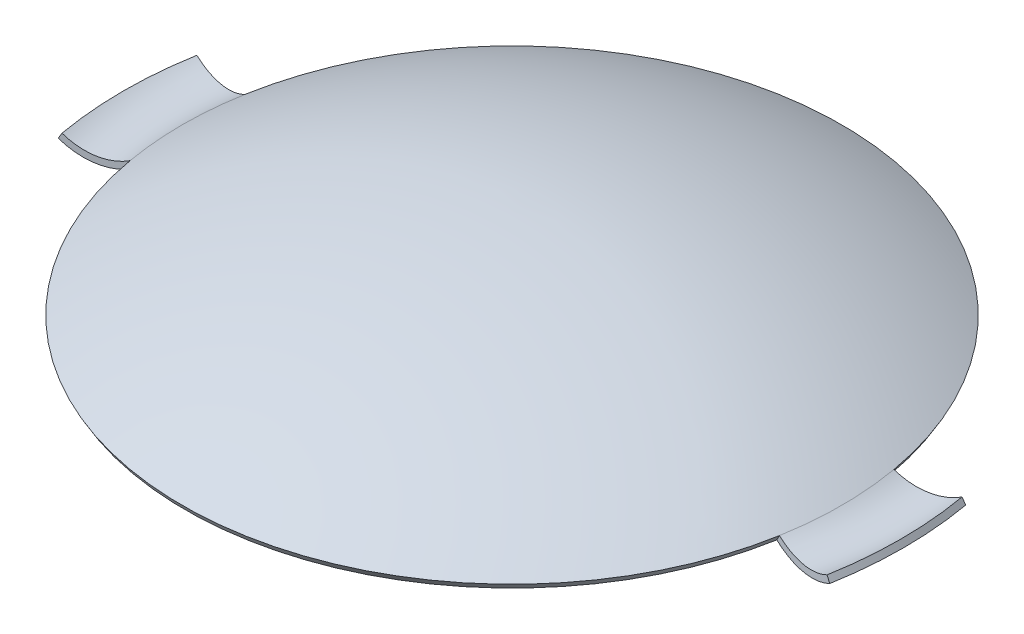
ISO-10303-21;
HEADER;
FILE_DESCRIPTION(('STEP AP214'),'2;1');
FILE_NAME('part.step','',(''),(''),'','','');
FILE_SCHEMA(('AUTOMOTIVE_DESIGN { 1 0 10303 214 1 1 1 1 }'));
ENDSEC;
DATA;
#1=APPLICATION_CONTEXT('core data for automotive mechanical design processes');
#2=APPLICATION_PROTOCOL_DEFINITION('international standard','automotive_design',2000,#1);
#3=PRODUCT_CONTEXT('',#1,'mechanical');
#4=PRODUCT('Part','Part','',(#3));
#5=PRODUCT_RELATED_PRODUCT_CATEGORY('part','',(#4));
#6=PRODUCT_DEFINITION_FORMATION('','',#4);
#7=PRODUCT_DEFINITION_CONTEXT('part definition',#1,'design');
#8=PRODUCT_DEFINITION('design','',#6,#7);
#9=PRODUCT_DEFINITION_SHAPE('','',#8);
#10=(LENGTH_UNIT() NAMED_UNIT(*) SI_UNIT(.MILLI.,.METRE.));
#11=(NAMED_UNIT(*) PLANE_ANGLE_UNIT() SI_UNIT($,.RADIAN.));
#12=(NAMED_UNIT(*) SI_UNIT($,.STERADIAN.) SOLID_ANGLE_UNIT());
#13=UNCERTAINTY_MEASURE_WITH_UNIT(LENGTH_MEASURE(1.E-05),#10,'distance_accuracy_value','');
#14=(GEOMETRIC_REPRESENTATION_CONTEXT(3) GLOBAL_UNCERTAINTY_ASSIGNED_CONTEXT((#13)) GLOBAL_UNIT_ASSIGNED_CONTEXT((#10,
#11,#12)) REPRESENTATION_CONTEXT('',''));
#15=CARTESIAN_POINT('',(0.,0.,0.));
#16=DIRECTION('',(0.,0.,1.));
#17=DIRECTION('',(1.,0.,0.));
#18=AXIS2_PLACEMENT_3D('',#15,#16,#17);
#19=CARTESIAN_POINT('',(0.,-25.0628684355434,0.));
#20=DIRECTION('',(0.,1.,0.));
#21=DIRECTION('',(-1.,0.,0.));
#22=AXIS2_PLACEMENT_3D('',#19,#20,#21);
#23=CONICAL_SURFACE('',#22,101.,0.523598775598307);
#24=CARTESIAN_POINT('',(0.,-26.7949192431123,0.));
#25=DIRECTION('',(0.,1.,0.));
#26=DIRECTION('',(-1.,0.,0.));
#27=AXIS2_PLACEMENT_3D('',#24,#25,#26);
#28=CIRCLE('',#27,100.);
#29=CARTESIAN_POINT('',(-98.4807753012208,-26.7949192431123,17.3648177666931));
#30=VERTEX_POINT('',#29);
#31=CARTESIAN_POINT('',(98.4807753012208,-26.7949192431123,17.3648177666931));
#32=VERTEX_POINT('',#31);
#33=EDGE_CURVE('E134',#30,#32,#28,.T.);
#34=ORIENTED_EDGE('',*,*,#33,.T.);
#35=DIRECTION('',(0.492403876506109,0.866025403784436,0.0868240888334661));
#36=VECTOR('',#35,1.);
#37=CARTESIAN_POINT('',(99.465583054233,-25.0628684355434,17.53846594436));
#38=LINE('',#37,#36);
#39=CARTESIAN_POINT('',(99.465583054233,-25.0628684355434,17.53846594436));
#40=VERTEX_POINT('',#39);
#41=EDGE_CURVE('E175',#32,#40,#38,.T.);
#42=ORIENTED_EDGE('',*,*,#41,.T.);
#43=CARTESIAN_POINT('',(0.,-25.0628684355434,0.));
#44=DIRECTION('',(0.,1.,0.));
#45=DIRECTION('',(-1.,0.,0.));
#46=AXIS2_PLACEMENT_3D('',#43,#44,#45);
#47=CIRCLE('',#46,101.);
#48=CARTESIAN_POINT('',(-99.465583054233,-25.0628684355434,17.53846594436));
#49=VERTEX_POINT('',#48);
#50=EDGE_CURVE('E11',#49,#40,#47,.T.);
#51=ORIENTED_EDGE('',*,*,#50,.F.);
#52=DIRECTION('',(-0.492403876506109,0.866025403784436,0.0868240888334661));
#53=VECTOR('',#52,1.);
#54=CARTESIAN_POINT('',(-99.465583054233,-25.0628684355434,17.53846594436));
#55=LINE('',#54,#53);
#56=EDGE_CURVE('E150',#30,#49,#55,.T.);
#57=ORIENTED_EDGE('',*,*,#56,.F.);
#58=EDGE_LOOP('',(#34,#42,#51,#57));
#59=FACE_BOUND('',#58,.T.);
#60=ADVANCED_FACE('F37',(#59),#23,.T.);
#61=DIRECTION('',(0.492403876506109,0.866025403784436,-0.0868240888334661));
#62=VECTOR('',#61,1.);
#63=CARTESIAN_POINT('',(99.465583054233,-25.0628684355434,-17.53846594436));
#64=LINE('',#63,#62);
#65=CARTESIAN_POINT('',(98.4807753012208,-26.7949192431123,-17.3648177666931));
#66=VERTEX_POINT('',#65);
#67=CARTESIAN_POINT('',(99.465583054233,-25.0628684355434,-17.53846594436));
#68=VERTEX_POINT('',#67);
#69=EDGE_CURVE('E106',#66,#68,#64,.T.);
#70=ORIENTED_EDGE('',*,*,#69,.F.);
#71=CARTESIAN_POINT('',(-98.4807753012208,-26.7949192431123,-17.3648177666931));
#72=VERTEX_POINT('',#71);
#73=EDGE_CURVE('E128',#66,#72,#28,.T.);
#74=ORIENTED_EDGE('',*,*,#73,.T.);
#75=DIRECTION('',(-0.492403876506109,0.866025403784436,-0.0868240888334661));
#76=VECTOR('',#75,1.);
#77=CARTESIAN_POINT('',(-99.465583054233,-25.0628684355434,-17.53846594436));
#78=LINE('',#77,#76);
#79=CARTESIAN_POINT('',(-99.465583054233,-25.0628684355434,-17.53846594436));
#80=VERTEX_POINT('',#79);
#81=EDGE_CURVE('E162',#72,#80,#78,.T.);
#82=ORIENTED_EDGE('',*,*,#81,.T.);
#83=EDGE_CURVE('E45',#68,#80,#47,.T.);
#84=ORIENTED_EDGE('',*,*,#83,.F.);
#85=EDGE_LOOP('',(#70,#74,#82,#84));
#86=FACE_BOUND('',#85,.T.);
#87=ADVANCED_FACE('F127',(#86),#23,.T.);
#88=CARTESIAN_POINT('',(0.,-200.,0.));
#89=DIRECTION('',(0.,1.,0.));
#90=DIRECTION('',(-1.,0.,0.));
#91=AXIS2_PLACEMENT_3D('',#88,#89,#90);
#92=SPHERICAL_SURFACE('',#91,200.);
#93=ORIENTED_EDGE('',*,*,#33,.F.);
#94=CARTESIAN_POINT('',(0.,-26.7949192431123,0.));
#95=DIRECTION('',(0.,-1.,0.));
#96=DIRECTION('',(1.,0.,0.));
#97=AXIS2_PLACEMENT_3D('',#94,#95,#96);
#98=CIRCLE('',#97,100.);
#99=EDGE_CURVE('E132',#30,#72,#98,.T.);
#100=ORIENTED_EDGE('',*,*,#99,.T.);
#101=ORIENTED_EDGE('',*,*,#73,.F.);
#102=CARTESIAN_POINT('',(0.,-26.7949192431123,0.));
#103=DIRECTION('',(0.,1.,0.));
#104=DIRECTION('',(-1.,0.,0.));
#105=AXIS2_PLACEMENT_3D('',#102,#103,#104);
#106=CIRCLE('',#105,100.);
#107=EDGE_CURVE('E115',#32,#66,#106,.T.);
#108=ORIENTED_EDGE('',*,*,#107,.F.);
#109=EDGE_LOOP('',(#93,#100,#101,#108));
#110=FACE_BOUND('',#109,.T.);
#111=ADVANCED_FACE('F39',(#110),#92,.F.);
#112=CARTESIAN_POINT('',(0.,-200.,0.));
#113=DIRECTION('',(0.,1.,0.));
#114=DIRECTION('',(-1.,0.,0.));
#115=AXIS2_PLACEMENT_3D('',#112,#113,#114);
#116=SPHERICAL_SURFACE('',#115,202.);
#117=ORIENTED_EDGE('',*,*,#50,.T.);
#118=CARTESIAN_POINT('',(0.,-25.0628684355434,0.));
#119=DIRECTION('',(0.,1.,0.));
#120=DIRECTION('',(-1.,0.,0.));
#121=AXIS2_PLACEMENT_3D('',#118,#119,#120);
#122=CIRCLE('',#121,101.);
#123=EDGE_CURVE('E123',#40,#68,#122,.T.);
#124=ORIENTED_EDGE('',*,*,#123,.T.);
#125=ORIENTED_EDGE('',*,*,#83,.T.);
#126=CARTESIAN_POINT('',(0.,-25.0628684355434,0.));
#127=DIRECTION('',(0.,-1.,0.));
#128=DIRECTION('',(1.,0.,0.));
#129=AXIS2_PLACEMENT_3D('',#126,#127,#128);
#130=CIRCLE('',#129,101.);
#131=EDGE_CURVE('E140',#49,#80,#130,.T.);
#132=ORIENTED_EDGE('',*,*,#131,.F.);
#133=EDGE_LOOP('',(#117,#124,#125,#132));
#134=FACE_BOUND('',#133,.T.);
#135=ADVANCED_FACE('F189',(#134),#116,.T.);
#136=CARTESIAN_POINT('',(0.,-9.47441116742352,0.));
#137=DIRECTION('',(0.,-1.,0.));
#138=DIRECTION('',(1.,0.,0.));
#139=AXIS2_PLACEMENT_3D('',#136,#137,#138);
#140=TOROIDAL_SURFACE('',#139,110.,20.);
#141=CARTESIAN_POINT('',(0.,-26.7949192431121,0.));
#142=DIRECTION('',(0.,-1.,0.));
#143=DIRECTION('',(1.,0.,0.));
#144=AXIS2_PLACEMENT_3D('',#141,#142,#143);
#145=CIRCLE('',#144,120.);
#146=CARTESIAN_POINT('',(-118.176930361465,-26.7949192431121,20.8377813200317));
#147=VERTEX_POINT('',#146);
#148=CARTESIAN_POINT('',(-118.176930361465,-26.7949192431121,-20.8377813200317));
#149=VERTEX_POINT('',#148);
#150=EDGE_CURVE('E135',#147,#149,#145,.T.);
#151=ORIENTED_EDGE('',*,*,#150,.T.);
#152=CARTESIAN_POINT('',(-108.328852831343,-9.47441116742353,-19.1012995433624));
#153=DIRECTION('',(-0.173648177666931,0.,0.984807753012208));
#154=DIRECTION('',(-0.984807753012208,0.,-0.173648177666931));
#155=AXIS2_PLACEMENT_3D('',#152,#153,#154);
#156=CIRCLE('',#155,20.);
#157=EDGE_CURVE('E164',#149,#72,#156,.T.);
#158=ORIENTED_EDGE('',*,*,#157,.T.);
#159=ORIENTED_EDGE('',*,*,#99,.F.);
#160=CARTESIAN_POINT('',(-108.328852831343,-9.47441116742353,19.1012995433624));
#161=DIRECTION('',(0.173648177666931,0.,0.984807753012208));
#162=DIRECTION('',(-0.984807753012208,0.,0.173648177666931));
#163=AXIS2_PLACEMENT_3D('',#160,#161,#162);
#164=CIRCLE('',#163,20.);
#165=EDGE_CURVE('E153',#147,#30,#164,.T.);
#166=ORIENTED_EDGE('',*,*,#165,.F.);
#167=EDGE_LOOP('',(#151,#158,#159,#166));
#168=FACE_BOUND('',#167,.T.);
#169=ADVANCED_FACE('F205',(#168),#140,.T.);
#170=CARTESIAN_POINT('',(0.,-25.0628684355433,0.));
#171=DIRECTION('',(0.,-1.,0.));
#172=DIRECTION('',(1.,0.,0.));
#173=AXIS2_PLACEMENT_3D('',#170,#171,#172);
#174=CONICAL_SURFACE('',#173,119.,0.523598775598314);
#175=CARTESIAN_POINT('',(0.,-25.0628684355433,0.));
#176=DIRECTION('',(0.,-1.,0.));
#177=DIRECTION('',(1.,0.,0.));
#178=AXIS2_PLACEMENT_3D('',#175,#176,#177);
#179=CIRCLE('',#178,119.);
#180=CARTESIAN_POINT('',(-117.192122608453,-25.0628684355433,20.6641331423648));
#181=VERTEX_POINT('',#180);
#182=CARTESIAN_POINT('',(-117.192122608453,-25.0628684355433,-20.6641331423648));
#183=VERTEX_POINT('',#182);
#184=EDGE_CURVE('E136',#181,#183,#179,.T.);
#185=ORIENTED_EDGE('',*,*,#184,.T.);
#186=DIRECTION('',(-0.492403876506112,-0.866025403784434,-0.0868240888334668));
#187=VECTOR('',#186,1.);
#188=CARTESIAN_POINT('',(-117.192122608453,-25.0628684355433,-20.6641331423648));
#189=LINE('',#188,#187);
#190=EDGE_CURVE('E156',#183,#149,#189,.T.);
#191=ORIENTED_EDGE('',*,*,#190,.T.);
#192=ORIENTED_EDGE('',*,*,#150,.F.);
#193=DIRECTION('',(-0.492403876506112,-0.866025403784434,0.0868240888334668));
#194=VECTOR('',#193,1.);
#195=CARTESIAN_POINT('',(-117.192122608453,-25.0628684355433,20.6641331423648));
#196=LINE('',#195,#194);
#197=EDGE_CURVE('E144',#181,#147,#196,.T.);
#198=ORIENTED_EDGE('',*,*,#197,.F.);
#199=EDGE_LOOP('',(#185,#191,#192,#198));
#200=FACE_BOUND('',#199,.T.);
#201=ADVANCED_FACE('F199',(#200),#174,.T.);
#202=CARTESIAN_POINT('',(0.,-9.47441116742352,0.));
#203=DIRECTION('',(0.,-1.,0.));
#204=DIRECTION('',(1.,0.,0.));
#205=AXIS2_PLACEMENT_3D('',#202,#203,#204);
#206=TOROIDAL_SURFACE('',#205,110.,18.);
#207=ORIENTED_EDGE('',*,*,#131,.T.);
#208=CARTESIAN_POINT('',(-108.328852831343,-9.47441116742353,-19.1012995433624));
#209=DIRECTION('',(0.173648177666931,0.,-0.984807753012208));
#210=DIRECTION('',(-0.984807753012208,0.,-0.173648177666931));
#211=AXIS2_PLACEMENT_3D('',#208,#209,#210);
#212=CIRCLE('',#211,18.);
#213=EDGE_CURVE('E159',#80,#183,#212,.T.);
#214=ORIENTED_EDGE('',*,*,#213,.T.);
#215=ORIENTED_EDGE('',*,*,#184,.F.);
#216=CARTESIAN_POINT('',(-108.328852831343,-9.47441116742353,19.1012995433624));
#217=DIRECTION('',(-0.173648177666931,0.,-0.984807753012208));
#218=DIRECTION('',(-0.984807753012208,0.,0.173648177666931));
#219=AXIS2_PLACEMENT_3D('',#216,#217,#218);
#220=CIRCLE('',#219,18.);
#221=EDGE_CURVE('E147',#49,#181,#220,.T.);
#222=ORIENTED_EDGE('',*,*,#221,.F.);
#223=EDGE_LOOP('',(#207,#214,#215,#222));
#224=FACE_BOUND('',#223,.T.);
#225=ADVANCED_FACE('F193',(#224),#206,.F.);
#226=CARTESIAN_POINT('',(-108.328852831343,-9.47441116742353,19.1012995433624));
#227=DIRECTION('',(-0.173648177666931,0.,-0.984807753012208));
#228=DIRECTION('',(-0.984807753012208,0.,0.173648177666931));
#229=AXIS2_PLACEMENT_3D('',#226,#227,#228);
#230=PLANE('',#229);
#231=ORIENTED_EDGE('',*,*,#165,.T.);
#232=ORIENTED_EDGE('',*,*,#56,.T.);
#233=ORIENTED_EDGE('',*,*,#221,.T.);
#234=ORIENTED_EDGE('',*,*,#197,.T.);
#235=EDGE_LOOP('',(#231,#232,#233,#234));
#236=FACE_BOUND('',#235,.T.);
#237=ADVANCED_FACE('F202',(#236),#230,.F.);
#238=CARTESIAN_POINT('',(-108.328852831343,-9.47441116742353,-19.1012995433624));
#239=DIRECTION('',(0.173648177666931,0.,-0.984807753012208));
#240=DIRECTION('',(-0.984807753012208,0.,-0.173648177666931));
#241=AXIS2_PLACEMENT_3D('',#238,#239,#240);
#242=PLANE('',#241);
#243=ORIENTED_EDGE('',*,*,#157,.F.);
#244=ORIENTED_EDGE('',*,*,#190,.F.);
#245=ORIENTED_EDGE('',*,*,#213,.F.);
#246=ORIENTED_EDGE('',*,*,#81,.F.);
#247=EDGE_LOOP('',(#243,#244,#245,#246));
#248=FACE_BOUND('',#247,.T.);
#249=ADVANCED_FACE('F197',(#248),#242,.T.);
#250=CARTESIAN_POINT('',(0.,-9.47441116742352,0.));
#251=DIRECTION('',(0.,-1.,0.));
#252=DIRECTION('',(-1.,0.,0.));
#253=AXIS2_PLACEMENT_3D('',#250,#251,#252);
#254=TOROIDAL_SURFACE('',#253,110.,20.);
#255=CARTESIAN_POINT('',(0.,-26.7949192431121,0.));
#256=DIRECTION('',(0.,1.,0.));
#257=DIRECTION('',(-1.,0.,0.));
#258=AXIS2_PLACEMENT_3D('',#255,#256,#257);
#259=CIRCLE('',#258,120.);
#260=CARTESIAN_POINT('',(118.176930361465,-26.7949192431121,20.8377813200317));
#261=VERTEX_POINT('',#260);
#262=CARTESIAN_POINT('',(118.176930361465,-26.7949192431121,-20.8377813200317));
#263=VERTEX_POINT('',#262);
#264=EDGE_CURVE('E167',#261,#263,#259,.T.);
#265=ORIENTED_EDGE('',*,*,#264,.F.);
#266=CARTESIAN_POINT('',(108.328852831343,-9.47441116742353,19.1012995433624));
#267=DIRECTION('',(0.173648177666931,0.,-0.984807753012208));
#268=DIRECTION('',(0.984807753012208,0.,0.173648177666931));
#269=AXIS2_PLACEMENT_3D('',#266,#267,#268);
#270=CIRCLE('',#269,20.);
#271=EDGE_CURVE('E118',#261,#32,#270,.T.);
#272=ORIENTED_EDGE('',*,*,#271,.T.);
#273=ORIENTED_EDGE('',*,*,#107,.T.);
#274=CARTESIAN_POINT('',(108.328852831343,-9.47441116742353,-19.1012995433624));
#275=DIRECTION('',(-0.173648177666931,0.,-0.984807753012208));
#276=DIRECTION('',(0.984807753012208,0.,-0.173648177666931));
#277=AXIS2_PLACEMENT_3D('',#274,#275,#276);
#278=CIRCLE('',#277,20.);
#279=EDGE_CURVE('E102',#263,#66,#278,.T.);
#280=ORIENTED_EDGE('',*,*,#279,.F.);
#281=EDGE_LOOP('',(#265,#272,#273,#280));
#282=FACE_BOUND('',#281,.T.);
#283=ADVANCED_FACE('F116',(#282),#254,.T.);
#284=CARTESIAN_POINT('',(0.,-25.0628684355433,0.));
#285=DIRECTION('',(0.,-1.,0.));
#286=DIRECTION('',(-1.,0.,0.));
#287=AXIS2_PLACEMENT_3D('',#284,#285,#286);
#288=CONICAL_SURFACE('',#287,119.,0.523598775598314);
#289=CARTESIAN_POINT('',(0.,-25.0628684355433,0.));
#290=DIRECTION('',(0.,1.,0.));
#291=DIRECTION('',(-1.,0.,0.));
#292=AXIS2_PLACEMENT_3D('',#289,#290,#291);
#293=CIRCLE('',#292,119.);
#294=CARTESIAN_POINT('',(117.192122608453,-25.0628684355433,20.6641331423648));
#295=VERTEX_POINT('',#294);
#296=CARTESIAN_POINT('',(117.192122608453,-25.0628684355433,-20.6641331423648));
#297=VERTEX_POINT('',#296);
#298=EDGE_CURVE('E169',#295,#297,#293,.T.);
#299=ORIENTED_EDGE('',*,*,#298,.F.);
#300=DIRECTION('',(0.492403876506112,-0.866025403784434,0.0868240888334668));
#301=VECTOR('',#300,1.);
#302=CARTESIAN_POINT('',(117.192122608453,-25.0628684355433,20.6641331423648));
#303=LINE('',#302,#301);
#304=EDGE_CURVE('E124',#295,#261,#303,.T.);
#305=ORIENTED_EDGE('',*,*,#304,.T.);
#306=ORIENTED_EDGE('',*,*,#264,.T.);
#307=DIRECTION('',(0.492403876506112,-0.866025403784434,-0.0868240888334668));
#308=VECTOR('',#307,1.);
#309=CARTESIAN_POINT('',(117.192122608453,-25.0628684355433,-20.6641331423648));
#310=LINE('',#309,#308);
#311=EDGE_CURVE('E108',#297,#263,#310,.T.);
#312=ORIENTED_EDGE('',*,*,#311,.F.);
#313=EDGE_LOOP('',(#299,#305,#306,#312));
#314=FACE_BOUND('',#313,.T.);
#315=ADVANCED_FACE('F182',(#314),#288,.T.);
#316=CARTESIAN_POINT('',(0.,-9.47441116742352,0.));
#317=DIRECTION('',(0.,-1.,0.));
#318=DIRECTION('',(-1.,0.,0.));
#319=AXIS2_PLACEMENT_3D('',#316,#317,#318);
#320=TOROIDAL_SURFACE('',#319,110.,18.);
#321=ORIENTED_EDGE('',*,*,#123,.F.);
#322=CARTESIAN_POINT('',(108.328852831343,-9.47441116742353,19.1012995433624));
#323=DIRECTION('',(-0.173648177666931,0.,0.984807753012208));
#324=DIRECTION('',(0.984807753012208,0.,0.173648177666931));
#325=AXIS2_PLACEMENT_3D('',#322,#323,#324);
#326=CIRCLE('',#325,18.);
#327=EDGE_CURVE('E173',#40,#295,#326,.T.);
#328=ORIENTED_EDGE('',*,*,#327,.T.);
#329=ORIENTED_EDGE('',*,*,#298,.T.);
#330=CARTESIAN_POINT('',(108.328852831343,-9.47441116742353,-19.1012995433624));
#331=DIRECTION('',(0.173648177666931,0.,0.984807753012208));
#332=DIRECTION('',(0.984807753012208,0.,-0.173648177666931));
#333=AXIS2_PLACEMENT_3D('',#330,#331,#332);
#334=CIRCLE('',#333,18.);
#335=EDGE_CURVE('E52',#68,#297,#334,.T.);
#336=ORIENTED_EDGE('',*,*,#335,.F.);
#337=EDGE_LOOP('',(#321,#328,#329,#336));
#338=FACE_BOUND('',#337,.T.);
#339=ADVANCED_FACE('F183',(#338),#320,.F.);
#340=CARTESIAN_POINT('',(108.328852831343,-9.47441116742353,19.1012995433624));
#341=DIRECTION('',(0.173648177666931,0.,-0.984807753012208));
#342=DIRECTION('',(0.984807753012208,0.,0.173648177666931));
#343=AXIS2_PLACEMENT_3D('',#340,#341,#342);
#344=PLANE('',#343);
#345=ORIENTED_EDGE('',*,*,#271,.F.);
#346=ORIENTED_EDGE('',*,*,#304,.F.);
#347=ORIENTED_EDGE('',*,*,#327,.F.);
#348=ORIENTED_EDGE('',*,*,#41,.F.);
#349=EDGE_LOOP('',(#345,#346,#347,#348));
#350=FACE_BOUND('',#349,.T.);
#351=ADVANCED_FACE('F186',(#350),#344,.F.);
#352=CARTESIAN_POINT('',(108.328852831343,-9.47441116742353,-19.1012995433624));
#353=DIRECTION('',(-0.173648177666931,0.,-0.984807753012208));
#354=DIRECTION('',(0.984807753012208,0.,-0.173648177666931));
#355=AXIS2_PLACEMENT_3D('',#352,#353,#354);
#356=PLANE('',#355);
#357=ORIENTED_EDGE('',*,*,#279,.T.);
#358=ORIENTED_EDGE('',*,*,#69,.T.);
#359=ORIENTED_EDGE('',*,*,#335,.T.);
#360=ORIENTED_EDGE('',*,*,#311,.T.);
#361=EDGE_LOOP('',(#357,#358,#359,#360));
#362=FACE_BOUND('',#361,.T.);
#363=ADVANCED_FACE('F104',(#362),#356,.T.);
#364=CLOSED_SHELL('',(#60,#87,#111,#135,#169,#201,#225,#237,#249,#283,#315,#339,#351,#363));
#365=MANIFOLD_SOLID_BREP('B2',#364);
#366=ADVANCED_BREP_SHAPE_REPRESENTATION('',(#18,#365),#14);
#367=SHAPE_DEFINITION_REPRESENTATION(#9,#366);
ENDSEC;
END-ISO-10303-21;
